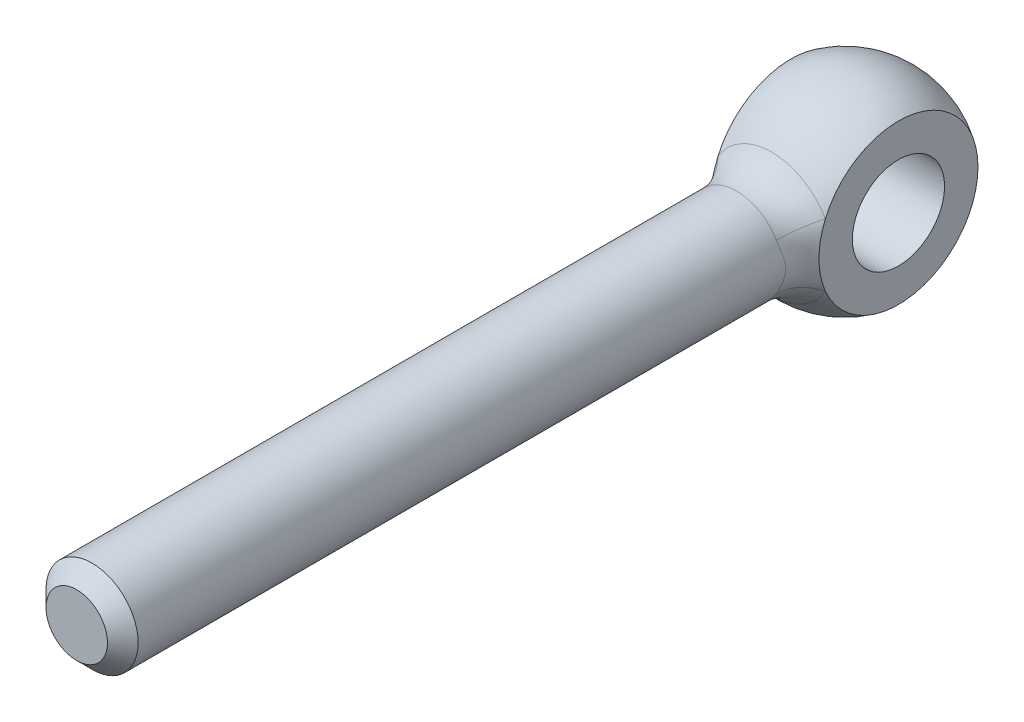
ISO-10303-21;
HEADER;
FILE_DESCRIPTION(('STEP AP214'),'2;1');
FILE_NAME('part.step','',(''),(''),'','','');
FILE_SCHEMA(('AUTOMOTIVE_DESIGN { 1 0 10303 214 1 1 1 1 }'));
ENDSEC;
DATA;
#1=APPLICATION_CONTEXT('core data for automotive mechanical design processes');
#2=APPLICATION_PROTOCOL_DEFINITION('international standard','automotive_design',2000,#1);
#3=PRODUCT_CONTEXT('',#1,'mechanical');
#4=PRODUCT('Part','Part','',(#3));
#5=PRODUCT_RELATED_PRODUCT_CATEGORY('part','',(#4));
#6=PRODUCT_DEFINITION_FORMATION('','',#4);
#7=PRODUCT_DEFINITION_CONTEXT('part definition',#1,'design');
#8=PRODUCT_DEFINITION('design','',#6,#7);
#9=PRODUCT_DEFINITION_SHAPE('','',#8);
#10=(LENGTH_UNIT() NAMED_UNIT(*) SI_UNIT(.MILLI.,.METRE.));
#11=(NAMED_UNIT(*) PLANE_ANGLE_UNIT() SI_UNIT($,.RADIAN.));
#12=(NAMED_UNIT(*) SI_UNIT($,.STERADIAN.) SOLID_ANGLE_UNIT());
#13=UNCERTAINTY_MEASURE_WITH_UNIT(LENGTH_MEASURE(1.E-05),#10,'distance_accuracy_value','');
#14=(GEOMETRIC_REPRESENTATION_CONTEXT(3) GLOBAL_UNCERTAINTY_ASSIGNED_CONTEXT((#13)) GLOBAL_UNIT_ASSIGNED_CONTEXT((#10,
#11,#12)) REPRESENTATION_CONTEXT('',''));
#15=CARTESIAN_POINT('',(0.,0.,0.));
#16=DIRECTION('',(0.,0.,1.));
#17=DIRECTION('',(1.,0.,0.));
#18=AXIS2_PLACEMENT_3D('',#15,#16,#17);
#19=CARTESIAN_POINT('',(0.,0.,0.));
#20=DIRECTION('',(-1.,0.,0.));
#21=DIRECTION('',(0.,0.,-1.));
#22=AXIS2_PLACEMENT_3D('',#19,#20,#21);
#23=SPHERICAL_SURFACE('',#22,12.5);
#24=CARTESIAN_POINT('',(7.,0.,0.));
#25=DIRECTION('',(1.,0.,0.));
#26=DIRECTION('',(0.,0.,1.));
#27=AXIS2_PLACEMENT_3D('',#24,#25,#26);
#28=CIRCLE('',#27,10.356157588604);
#29=CARTESIAN_POINT('',(7.,4.09162768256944,9.51359989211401));
#30=VERTEX_POINT('',#29);
#31=CARTESIAN_POINT('',(7.,-4.09162768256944,9.51359989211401));
#32=VERTEX_POINT('',#31);
#33=EDGE_CURVE('E64',#30,#32,#28,.F.);
#34=ORIENTED_EDGE('',*,*,#33,.T.);
#35=CARTESIAN_POINT('',(0.,0.,9.51359989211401));
#36=DIRECTION('',(0.,0.,-1.));
#37=DIRECTION('',(-1.,0.,0.));
#38=AXIS2_PLACEMENT_3D('',#35,#36,#37);
#39=CIRCLE('',#38,8.10810810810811);
#40=CARTESIAN_POINT('',(-7.,-4.09162768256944,9.51359989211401));
#41=VERTEX_POINT('',#40);
#42=EDGE_CURVE('E72',#32,#41,#39,.T.);
#43=ORIENTED_EDGE('',*,*,#42,.T.);
#44=CARTESIAN_POINT('',(-7.,0.,0.));
#45=DIRECTION('',(1.,0.,0.));
#46=DIRECTION('',(0.,0.,1.));
#47=AXIS2_PLACEMENT_3D('',#44,#45,#46);
#48=CIRCLE('',#47,10.356157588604);
#49=CARTESIAN_POINT('',(-7.,4.09162768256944,9.51359989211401));
#50=VERTEX_POINT('',#49);
#51=EDGE_CURVE('E60',#50,#41,#48,.F.);
#52=ORIENTED_EDGE('',*,*,#51,.F.);
#53=CARTESIAN_POINT('',(0.,0.,9.51359989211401));
#54=DIRECTION('',(0.,0.,-1.));
#55=DIRECTION('',(-1.,0.,0.));
#56=AXIS2_PLACEMENT_3D('',#53,#54,#55);
#57=CIRCLE('',#56,8.10810810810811);
#58=EDGE_CURVE('E69',#50,#30,#57,.T.);
#59=ORIENTED_EDGE('',*,*,#58,.T.);
#60=EDGE_LOOP('',(#34,#43,#52,#59));
#61=FACE_BOUND('',#60,.T.);
#62=ADVANCED_FACE('F14',(#61),#23,.T.);
#63=CARTESIAN_POINT('',(0.,0.,-10.));
#64=DIRECTION('',(0.,0.,-1.));
#65=DIRECTION('',(1.,0.,0.));
#66=AXIS2_PLACEMENT_3D('',#63,#64,#65);
#67=CYLINDRICAL_SURFACE('',#66,6.);
#68=CARTESIAN_POINT('',(7.,5.52065398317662,8.76198491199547));
#69=CARTESIAN_POINT('',(4.73347627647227,3.77093452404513,10.4723797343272));
#70=CARTESIAN_POINT('',(4.16393928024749,4.31990852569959,13.7124960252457));
#71=CARTESIAN_POINT('',(7.,5.43196770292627,8.81784504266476));
#72=CARTESIAN_POINT('',(4.75237008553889,3.73175735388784,10.5424849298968));
#73=CARTESIAN_POINT('',(4.24629318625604,4.24055975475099,13.7683625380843));
#74=CARTESIAN_POINT('',(7.,5.34113250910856,8.87321411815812));
#75=CARTESIAN_POINT('',(4.774361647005,3.69082707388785,10.6107881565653));
#76=CARTESIAN_POINT('',(4.32694937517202,4.15824402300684,13.8171854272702));
#77=CARTESIAN_POINT('',(7.,5.15454022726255,8.98290118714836));
#78=CARTESIAN_POINT('',(4.82415359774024,3.60403478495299,10.743005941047));
#79=CARTESIAN_POINT('',(4.48416075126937,3.98818699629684,13.9015926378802));
#80=CARTESIAN_POINT('',(7.,5.05878355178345,9.03721926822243));
#81=CARTESIAN_POINT('',(4.85191265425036,3.55821882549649,10.8069099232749));
#82=CARTESIAN_POINT('',(4.56071628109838,3.90044615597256,13.9371780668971));
#83=CARTESIAN_POINT('',(7.,4.86225075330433,9.14444949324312));
#84=CARTESIAN_POINT('',(4.91269251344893,3.46043710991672,10.9295511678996));
#85=CARTESIAN_POINT('',(4.70862752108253,3.72052921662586,13.9958066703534));
#86=CARTESIAN_POINT('',(7.,4.76150508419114,9.19736772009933));
#87=CARTESIAN_POINT('',(4.94564175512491,3.40856162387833,10.988313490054));
#88=CARTESIAN_POINT('',(4.78000947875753,3.62838012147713,14.0189176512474));
#89=CARTESIAN_POINT('',(7.,4.55392848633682,9.30189435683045));
#90=CARTESIAN_POINT('',(5.01603086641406,3.29716736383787,11.1005263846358));
#91=CARTESIAN_POINT('',(4.91748494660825,3.4397597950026,14.0539297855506));
#92=CARTESIAN_POINT('',(7.,4.44710008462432,9.35350329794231));
#93=CARTESIAN_POINT('',(5.05343304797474,3.23771146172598,11.1539919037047));
#94=CARTESIAN_POINT('',(4.98358062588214,3.3432903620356,14.0658355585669));
#95=CARTESIAN_POINT('',(7.,4.2969586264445,9.42274283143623));
#96=CARTESIAN_POINT('',(5.10676472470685,3.15059746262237,11.2230561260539));
#97=CARTESIAN_POINT('',(5.06977684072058,3.20923152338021,14.0752452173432));
#98=CARTESIAN_POINT('',(7.,4.25653508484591,9.44107582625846));
#99=CARTESIAN_POINT('',(5.12115703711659,3.12687435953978,11.2410365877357));
#100=CARTESIAN_POINT('',(5.09235610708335,3.17328084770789,14.0770920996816));
#101=CARTESIAN_POINT('',(7.,4.17477524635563,9.4775130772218));
#102=CARTESIAN_POINT('',(5.15031007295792,3.07824781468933,11.2762248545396));
#103=CARTESIAN_POINT('',(5.13675282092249,3.10089882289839,14.0795339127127));
#104=CARTESIAN_POINT('',(7.,4.13343888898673,9.4956173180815));
#105=CARTESIAN_POINT('',(5.16506981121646,3.05334717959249,11.2934339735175));
#106=CARTESIAN_POINT('',(5.15857021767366,3.06446744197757,14.0801287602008));
#107=CARTESIAN_POINT('',(7.,3.93727090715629,9.57998716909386));
#108=CARTESIAN_POINT('',(5.23484389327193,2.93397708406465,11.3720989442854));
#109=CARTESIAN_POINT('',(5.25911352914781,2.89245379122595,14.0801244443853));
#110=CARTESIAN_POINT('',(7.,3.77644238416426,9.64471624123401));
#111=CARTESIAN_POINT('',(5.29198516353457,2.8314905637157,11.4288485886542));
#112=CARTESIAN_POINT('',(5.33294423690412,2.75394693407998,14.0720012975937));
#113=CARTESIAN_POINT('',(7.,3.44057965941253,9.7695721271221));
#114=CARTESIAN_POINT('',(5.40674389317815,2.60847852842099,11.5309624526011));
#115=CARTESIAN_POINT('',(5.46944812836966,2.47178930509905,14.0431824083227));
#116=CARTESIAN_POINT('',(7.,3.26553398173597,9.82969514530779));
#117=CARTESIAN_POINT('',(5.46437197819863,2.48805001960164,11.5764173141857));
#118=CARTESIAN_POINT('',(5.53211216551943,2.3281344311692,14.0224764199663));
#119=CARTESIAN_POINT('',(7.,2.89956860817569,9.94381011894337));
#120=CARTESIAN_POINT('',(5.57626625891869,2.2285734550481,11.6561394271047));
#121=CARTESIAN_POINT('',(5.64613166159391,2.03613701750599,13.9728223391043));
#122=CARTESIAN_POINT('',(7.,2.70859175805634,9.99777819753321));
#123=CARTESIAN_POINT('',(5.63058064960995,2.08950571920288,11.6904716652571));
#124=CARTESIAN_POINT('',(5.69744376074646,1.88777889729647,13.9438435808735));
#125=CARTESIAN_POINT('',(7.,2.31090588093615,10.0971127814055));
#126=CARTESIAN_POINT('',(5.73158522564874,1.79407236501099,11.7485069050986));
#127=CARTESIAN_POINT('',(5.78825827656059,1.58765614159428,13.8830399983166));
#128=CARTESIAN_POINT('',(7.,2.10419766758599,10.1424797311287));
#129=CARTESIAN_POINT('',(5.77837504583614,1.6376681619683,11.7723070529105));
#130=CARTESIAN_POINT('',(5.82776130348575,1.43589168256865,13.8512153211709));
#131=CARTESIAN_POINT('',(7.,1.67085359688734,10.2229078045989));
#132=CARTESIAN_POINT('',(5.86150775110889,1.30600608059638,11.8111628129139));
#133=CARTESIAN_POINT('',(5.8955793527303,1.12600155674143,13.7902383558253));
#134=CARTESIAN_POINT('',(7.,1.44386630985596,10.2577049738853));
#135=CARTESIAN_POINT('',(5.8977103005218,1.13021047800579,11.8260828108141));
#136=CARTESIAN_POINT('',(5.92361308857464,0.967810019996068,13.7611653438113));
#137=CARTESIAN_POINT('',(7.,0.977611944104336,10.312575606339));
#138=CARTESIAN_POINT('',(5.95469562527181,0.767202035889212,11.8481867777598));
#139=CARTESIAN_POINT('',(5.96692621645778,0.649309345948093,13.7134560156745));
#140=CARTESIAN_POINT('',(7.,0.738348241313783,10.3326530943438));
#141=CARTESIAN_POINT('',(5.97558995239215,0.579692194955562,11.855420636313));
#142=CARTESIAN_POINT('',(5.98220909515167,0.489000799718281,13.6948168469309));
#143=CARTESIAN_POINT('',(7.,0.254575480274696,10.3558486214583));
#144=CARTESIAN_POINT('',(5.99967335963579,0.200191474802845,11.8636655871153));
#145=CARTESIAN_POINT('',(5.99980579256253,0.167748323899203,13.673156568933));
#146=CARTESIAN_POINT('',(7.,0.0100795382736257,10.3590049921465));
#147=CARTESIAN_POINT('',(6.0029543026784,0.00781202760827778,11.864708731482));
#148=CARTESIAN_POINT('',(6.00214892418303,0.00680665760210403,13.670100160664));
#149=CARTESIAN_POINT('',(7.,-0.476166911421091,10.3480653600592));
#150=CARTESIAN_POINT('',(5.99159819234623,-0.374022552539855,11.8609024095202));
#151=CARTESIAN_POINT('',(5.9939026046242,-0.314617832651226,13.6804268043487));
#152=CARTESIAN_POINT('',(7.,-0.717917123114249,10.3339675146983));
#153=CARTESIAN_POINT('',(5.97693421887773,-0.563895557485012,11.8560440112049));
#154=CARTESIAN_POINT('',(5.98331177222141,-0.475100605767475,13.6938116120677));
#155=CARTESIAN_POINT('',(7.,-1.17711086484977,10.2914790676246));
#156=CARTESIAN_POINT('',(5.93280719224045,-0.922682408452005,11.839841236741));
#157=CARTESIAN_POINT('',(5.95036755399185,-0.784814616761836,13.7319958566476));
#158=CARTESIAN_POINT('',(7.,-1.39514583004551,10.2639850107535));
#159=CARTESIAN_POINT('',(5.90419169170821,-1.09249310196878,11.8288660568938));
#160=CARTESIAN_POINT('',(5.92874844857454,-0.934149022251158,13.7560718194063));
#161=CARTESIAN_POINT('',(7.,-1.81839648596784,10.1975189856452));
#162=CARTESIAN_POINT('',(5.83527764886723,-1.41926666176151,11.7992510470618));
#163=CARTESIAN_POINT('',(5.87439634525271,-1.23051561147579,13.809953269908));
#164=CARTESIAN_POINT('',(7.,-2.02361108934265,10.1585460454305));
#165=CARTESIAN_POINT('',(5.79487748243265,-1.57641328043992,11.7805559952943));
#166=CARTESIAN_POINT('',(5.84166240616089,-1.37754759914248,13.8397592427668));
#167=CARTESIAN_POINT('',(7.,-2.41979553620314,10.0715339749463));
#168=CARTESIAN_POINT('',(5.70553324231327,-1.87549175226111,11.7340817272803));
#169=CARTESIAN_POINT('',(5.76521762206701,-1.66881679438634,13.8994060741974));
#170=CARTESIAN_POINT('',(7.,-2.61075717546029,10.0234896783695));
#171=CARTESIAN_POINT('',(5.65648641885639,-2.01749587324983,11.7062202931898));
#172=CARTESIAN_POINT('',(5.72150051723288,-1.81305235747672,13.9292469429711));
#173=CARTESIAN_POINT('',(7.,-2.97823759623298,9.92051035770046));
#174=CARTESIAN_POINT('',(5.55330052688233,-2.28497381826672,11.6404397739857));
#175=CARTESIAN_POINT('',(5.6232485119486,-2.09804332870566,13.9837841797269));
#176=CARTESIAN_POINT('',(7.,-3.15475790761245,9.86557606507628));
#177=CARTESIAN_POINT('',(5.49908883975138,-2.41044201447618,11.6024299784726));
#178=CARTESIAN_POINT('',(5.56871475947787,-2.2387991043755,14.0084810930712));
#179=CARTESIAN_POINT('',(7.,-3.47765739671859,9.7561304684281));
#180=CARTESIAN_POINT('',(5.39445517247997,-2.63320590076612,11.5201628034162));
#181=CARTESIAN_POINT('',(5.45483407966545,-2.50267587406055,14.0464316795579));
#182=CARTESIAN_POINT('',(7.,-3.62530052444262,9.70209213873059));
#183=CARTESIAN_POINT('',(5.34411434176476,-2.73206566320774,11.4767663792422));
#184=CARTESIAN_POINT('',(5.39646281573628,-2.62618577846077,14.0605611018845));
#185=CARTESIAN_POINT('',(7.,-3.9101338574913,9.59083995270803));
#186=CARTESIAN_POINT('',(5.2447017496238,-2.9165097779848,11.3815427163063));
#187=CARTESIAN_POINT('',(5.27135185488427,-2.86906036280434,14.0783371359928));
#188=CARTESIAN_POINT('',(7.,-4.04732718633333,9.53362705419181));
#189=CARTESIAN_POINT('',(5.19563379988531,-3.00201545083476,11.3296558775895));
#190=CARTESIAN_POINT('',(5.2046146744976,-2.98842627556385,14.0819868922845));
#191=CARTESIAN_POINT('',(7.,-4.31290967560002,9.41647692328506));
#192=CARTESIAN_POINT('',(5.10089049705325,-3.16117080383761,11.2175543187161));
#193=CARTESIAN_POINT('',(5.0627722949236,-3.22291536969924,14.0764425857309));
#194=CARTESIAN_POINT('',(7.,-4.44124691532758,9.35652657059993));
#195=CARTESIAN_POINT('',(5.05526955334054,-3.23465246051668,11.1572503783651));
#196=CARTESIAN_POINT('',(4.98762357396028,-3.33801195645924,14.0671785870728));
#197=CARTESIAN_POINT('',(7.,-4.68940217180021,9.23463387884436));
#198=CARTESIAN_POINT('',(4.96955301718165,-3.37092279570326,11.0291198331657));
#199=CARTESIAN_POINT('',(4.82981665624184,-3.56255813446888,14.0336945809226));
#200=CARTESIAN_POINT('',(7.,-4.80920993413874,9.17268926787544));
#201=CARTESIAN_POINT('',(4.92951762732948,-3.43360058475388,10.9612577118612));
#202=CARTESIAN_POINT('',(4.74714968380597,-3.67200088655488,14.0094568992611));
#203=CARTESIAN_POINT('',(7.,-4.92515727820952,9.11003983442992));
#204=CARTESIAN_POINT('',(4.89339612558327,-3.49152887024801,10.8902848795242));
#205=CARTESIAN_POINT('',(4.66109414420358,-3.77812140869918,13.9767461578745));
#206=(BOUNDED_SURFACE() B_SPLINE_SURFACE(3,2,((#68,#69,#70),(#71,#72,#73),(#74,#75,#76),(#77,
#78,#79),(#80,#81,#82),(#83,#84,#85),(#86,#87,#88),(#89,#90,#91),(#92,#93,#94),(#95,#96,#97),
(#98,#99,#100),(#101,#102,#103),(#104,#105,#106),(#107,#108,#109),(#110,#111,#112),(#113,#114,
#115),(#116,#117,#118),(#119,#120,#121),(#122,#123,#124),(#125,#126,#127),(#128,#129,#130),
(#131,#132,#133),(#134,#135,#136),(#137,#138,#139),(#140,#141,#142),(#143,#144,#145),(#146,#147,
#148),(#149,#150,#151),(#152,#153,#154),(#155,#156,#157),(#158,#159,#160),(#161,#162,#163),
(#164,#165,#166),(#167,#168,#169),(#170,#171,#172),(#173,#174,#175),(#176,#177,#178),(#179,#180,
#181),(#182,#183,#184),(#185,#186,#187),(#188,#189,#190),(#191,#192,#193),(#194,#195,#196),
(#197,#198,#199),(#200,#201,#202),(#203,#204,#205)),.UNSPECIFIED.,.F.,.F.,
.F.) B_SPLINE_SURFACE_WITH_KNOTS((4,2,2,2,2,2,2,2,2,2,2,2,2,2,2,2,2,2,2,2,2,2,4),(3,3),(0.,
0.706069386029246,1.41207968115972,2.11421270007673,2.8160561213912,3.07081429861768,
3.32558940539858,4.26615695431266,5.20749141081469,6.15236157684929,7.09718290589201,
8.06395765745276,9.03046796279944,9.99478789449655,10.9592108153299,11.8664791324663,
12.7738242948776,13.6816877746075,14.5894549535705,15.4094238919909,16.2291467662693,
17.0533262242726,17.8784803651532),(0.,1.),
.UNSPECIFIED.) GEOMETRIC_REPRESENTATION_ITEM() RATIONAL_B_SPLINE_SURFACE(((1.,0.874036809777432,
1.),(1.,0.875980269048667,1.),(1.,0.878049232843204,1.),(1.,0.882404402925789,1.),(1.,
0.884690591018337,1.),(1.,0.889433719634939,1.),(1.,0.891889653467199,1.),(1.,0.896934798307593,
1.),(1.,0.899523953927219,1.),(1.,0.903105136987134,1.),(1.,0.904063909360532,1.),(1.,
0.905988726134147,1.),(1.,0.906954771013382,1.),(1.,0.911497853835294,1.),(1.,0.915103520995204,
1.),(1.,0.922211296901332,1.),(1.,0.925713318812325,1.),(1.,0.932445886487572,1.),(1.,
0.935675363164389,1.),(1.,0.941657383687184,1.),(1.,0.944409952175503,1.),(1.,0.94930028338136,
1.),(1.,0.951422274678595,1.),(1.,0.95476877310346,1.),(1.,0.955993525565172,1.),(1.,
0.957408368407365,1.),(1.,0.957600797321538,1.),(1.,0.956933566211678,1.),(1.,0.956073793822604,
1.),(1.,0.953481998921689,1.),(1.,0.951804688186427,1.),(1.,0.947755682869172,1.),(1.,
0.94538392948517,1.),(1.,0.940114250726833,1.),(1.,0.937216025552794,1.),(1.,0.931066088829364,
1.),(1.,0.927814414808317,1.),(1.,0.921446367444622,1.),(1.,0.918347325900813,1.),(1.,
0.912110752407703,1.),(1.,0.908973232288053,1.),(1.,0.902748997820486,1.),(1.,0.899662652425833,
1.),(1.,0.893647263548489,1.),(1.,0.890718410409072,1.),(1.,0.887916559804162,1.))) REPRESENTATION_ITEM('') SURFACE());
#207=CARTESIAN_POINT('',(4.66109414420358,-3.77812140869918,13.9767461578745));
#208=CARTESIAN_POINT('',(4.74714968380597,-3.67200088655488,14.0094568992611));
#209=CARTESIAN_POINT('',(4.82981665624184,-3.56255813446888,14.0336945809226));
#210=CARTESIAN_POINT('',(4.98762357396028,-3.33801195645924,14.0671785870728));
#211=CARTESIAN_POINT('',(5.0627722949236,-3.22291536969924,14.0764425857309));
#212=CARTESIAN_POINT('',(5.2046146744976,-2.98842627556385,14.0819868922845));
#213=CARTESIAN_POINT('',(5.27135185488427,-2.86906036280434,14.0783371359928));
#214=CARTESIAN_POINT('',(5.39646281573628,-2.62618577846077,14.0605611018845));
#215=CARTESIAN_POINT('',(5.45483407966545,-2.50267587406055,14.0464316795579));
#216=CARTESIAN_POINT('',(5.56871475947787,-2.2387991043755,14.0084810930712));
#217=CARTESIAN_POINT('',(5.6232485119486,-2.09804332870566,13.9837841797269));
#218=CARTESIAN_POINT('',(5.72150051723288,-1.81305235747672,13.9292469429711));
#219=CARTESIAN_POINT('',(5.76521762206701,-1.66881679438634,13.8994060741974));
#220=CARTESIAN_POINT('',(5.84166240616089,-1.37754759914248,13.8397592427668));
#221=CARTESIAN_POINT('',(5.87439634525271,-1.23051561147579,13.809953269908));
#222=CARTESIAN_POINT('',(5.92874844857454,-0.934149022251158,13.7560718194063));
#223=CARTESIAN_POINT('',(5.95036755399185,-0.784814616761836,13.7319958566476));
#224=CARTESIAN_POINT('',(5.98331177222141,-0.475100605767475,13.6938116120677));
#225=CARTESIAN_POINT('',(5.9939026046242,-0.314617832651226,13.6804268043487));
#226=CARTESIAN_POINT('',(6.00214892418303,0.00680665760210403,13.670100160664));
#227=CARTESIAN_POINT('',(5.99980579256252,0.167748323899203,13.673156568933));
#228=CARTESIAN_POINT('',(5.98220909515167,0.489000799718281,13.6948168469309));
#229=CARTESIAN_POINT('',(5.96692621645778,0.649309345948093,13.7134560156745));
#230=CARTESIAN_POINT('',(5.92361308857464,0.967810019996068,13.7611653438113));
#231=CARTESIAN_POINT('',(5.8955793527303,1.12600155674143,13.7902383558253));
#232=CARTESIAN_POINT('',(5.82776130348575,1.43589168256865,13.8512153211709));
#233=CARTESIAN_POINT('',(5.78825827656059,1.58765614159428,13.8830399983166));
#234=CARTESIAN_POINT('',(5.69744376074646,1.88777889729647,13.9438435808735));
#235=CARTESIAN_POINT('',(5.64613166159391,2.03613701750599,13.9728223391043));
#236=CARTESIAN_POINT('',(5.53211216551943,2.3281344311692,14.0224764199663));
#237=CARTESIAN_POINT('',(5.46944812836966,2.47178930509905,14.0431824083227));
#238=CARTESIAN_POINT('',(5.33294423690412,2.75394693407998,14.0720012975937));
#239=CARTESIAN_POINT('',(5.2591135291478,2.89245379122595,14.0801244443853));
#240=CARTESIAN_POINT('',(5.15857021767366,3.06446744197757,14.0801287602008));
#241=CARTESIAN_POINT('',(5.13675282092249,3.10089882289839,14.0795339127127));
#242=CARTESIAN_POINT('',(5.09235610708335,3.17328084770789,14.0770920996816));
#243=CARTESIAN_POINT('',(5.06977684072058,3.20923152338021,14.0752452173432));
#244=CARTESIAN_POINT('',(4.98358062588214,3.3432903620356,14.0658355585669));
#245=CARTESIAN_POINT('',(4.91748494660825,3.4397597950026,14.0539297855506));
#246=CARTESIAN_POINT('',(4.78000947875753,3.62838012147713,14.0189176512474));
#247=CARTESIAN_POINT('',(4.70862752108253,3.72052921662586,13.9958066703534));
#248=CARTESIAN_POINT('',(4.56071628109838,3.90044615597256,13.9371780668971));
#249=CARTESIAN_POINT('',(4.48416075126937,3.98818699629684,13.9015926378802));
#250=CARTESIAN_POINT('',(4.32694937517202,4.15824402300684,13.8171854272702));
#251=CARTESIAN_POINT('',(4.24629318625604,4.24055975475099,13.7683625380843));
#252=CARTESIAN_POINT('',(4.16393928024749,4.31990852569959,13.7124960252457));
#253=B_SPLINE_CURVE_WITH_KNOTS('',3,(#207,#208,#209,#210,#211,#212,#213,#214,#215,#216,#217,
#218,#219,#220,#221,#222,#223,#224,#225,#226,#227,#228,#229,#230,#231,#232,#233,#234,#235,#236,
#237,#238,#239,#240,#241,#242,#243,#244,#245,#246,#247,#248,#249,#250,#251,#252),.UNSPECIFIED.,
.F.,.F.,(4,2,2,2,2,2,2,2,2,2,2,2,2,2,2,2,2,2,2,2,2,2,4),(0.,0.825154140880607,1.64933359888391,
2.46905647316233,3.28902541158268,4.19679259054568,5.10465607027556,6.01200123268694,
6.91926954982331,7.88369247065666,8.84801240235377,9.81452270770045,10.7812974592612,
11.7261187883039,12.6709889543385,13.6123234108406,14.5528909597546,14.8076660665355,
15.062424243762,15.7642676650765,16.4664006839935,17.172410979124,17.8784803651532),.UNSPECIFIED.);
#254=CARTESIAN_POINT('',(5.18,-3.02780448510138,14.0801278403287));
#255=VERTEX_POINT('',#254);
#256=CARTESIAN_POINT('',(5.18,3.02780448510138,14.0801278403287));
#257=VERTEX_POINT('',#256);
#258=EDGE_CURVE('E87',#255,#257,#253,.T.);
#259=ORIENTED_EDGE('',*,*,#258,.T.);
#260=CARTESIAN_POINT('',(0.,0.,14.0801278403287));
#261=DIRECTION('',(0.,0.,-1.));
#262=DIRECTION('',(-1.,0.,0.));
#263=AXIS2_PLACEMENT_3D('',#260,#261,#262);
#264=CIRCLE('',#263,6.);
#265=CARTESIAN_POINT('',(-5.18,3.02780448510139,14.0801278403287));
#266=VERTEX_POINT('',#265);
#267=EDGE_CURVE('E9',#257,#266,#264,.F.);
#268=ORIENTED_EDGE('',*,*,#267,.T.);
#269=CARTESIAN_POINT('',(-7.,-5.52065404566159,8.76198487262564));
#270=CARTESIAN_POINT('',(-4.73347625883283,-3.77093454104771,10.4723796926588));
#271=CARTESIAN_POINT('',(-4.16393928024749,-4.31990852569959,13.7124960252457));
#272=CARTESIAN_POINT('',(-7.,-5.43196772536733,8.81784502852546));
#273=CARTESIAN_POINT('',(-4.7523700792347,-3.73175735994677,10.5424849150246));
#274=CARTESIAN_POINT('',(-4.24629318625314,-4.24055975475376,13.7683625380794));
#275=CARTESIAN_POINT('',(-7.,-5.34113251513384,8.87321411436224));
#276=CARTESIAN_POINT('',(-4.77436164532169,-3.69082707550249,10.610788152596));
#277=CARTESIAN_POINT('',(-4.3269493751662,-4.15824402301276,13.8171854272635));
#278=CARTESIAN_POINT('',(-7.,-5.15454022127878,8.98290119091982));
#279=CARTESIAN_POINT('',(-4.82415359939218,-3.60403478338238,10.7430059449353));
#280=CARTESIAN_POINT('',(-4.48416075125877,-3.98818699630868,13.9015926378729));
#281=CARTESIAN_POINT('',(-7.,-5.05878355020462,9.03721926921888));
#282=CARTESIAN_POINT('',(-4.85191265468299,-3.55821882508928,10.8069099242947));
#283=CARTESIAN_POINT('',(-4.56071628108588,-3.90044615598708,13.937178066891));
#284=CARTESIAN_POINT('',(-7.,-4.86225075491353,9.14444949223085));
#285=CARTESIAN_POINT('',(-4.91269251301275,-3.46043711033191,10.9295511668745));
#286=CARTESIAN_POINT('',(-4.70862752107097,-3.7205292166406,13.9958066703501));
#287=CARTESIAN_POINT('',(-7.,-4.76150508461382,9.19736771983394));
#288=CARTESIAN_POINT('',(-4.94564175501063,-3.40856162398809,10.9883134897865));
#289=CARTESIAN_POINT('',(-4.78000947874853,-3.62838012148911,14.018917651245));
#290=CARTESIAN_POINT('',(-7.,-4.55392848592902,9.30189435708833));
#291=CARTESIAN_POINT('',(-5.0160308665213,-3.29716736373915,11.1005263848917));
#292=CARTESIAN_POINT('',(-4.91748494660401,-3.43975979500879,14.0539297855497));
#293=CARTESIAN_POINT('',(-7.,-4.44710008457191,9.35350329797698));
#294=CARTESIAN_POINT('',(-5.0534330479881,-3.23771146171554,11.1539919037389));
#295=CARTESIAN_POINT('',(-4.9835806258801,-3.34329036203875,14.0658355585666));
#296=CARTESIAN_POINT('',(-7.,-4.29695862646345,9.42274283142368));
#297=CARTESIAN_POINT('',(-5.10676472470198,-3.15059746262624,11.2230561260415));
#298=CARTESIAN_POINT('',(-5.06977684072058,-3.20923152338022,14.0752452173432));
#299=CARTESIAN_POINT('',(-7.,-4.25653508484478,9.44107582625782));
#300=CARTESIAN_POINT('',(-5.12115703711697,-3.12687435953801,11.241036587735));
#301=CARTESIAN_POINT('',(-5.09235610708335,-3.1732808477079,14.0770920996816));
#302=CARTESIAN_POINT('',(-7.,-4.17477524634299,9.47751307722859));
#303=CARTESIAN_POINT('',(-5.15031007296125,-3.07824781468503,11.2762248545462));
#304=CARTESIAN_POINT('',(-5.13675282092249,-3.1008988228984,14.0795339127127));
#305=CARTESIAN_POINT('',(-7.,-4.13343888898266,9.49561731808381));
#306=CARTESIAN_POINT('',(-5.16506981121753,-3.05334717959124,11.2934339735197));
#307=CARTESIAN_POINT('',(-5.15857021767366,-3.06446744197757,14.0801287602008));
#308=CARTESIAN_POINT('',(-7.,-3.93727090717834,9.57998716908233));
#309=CARTESIAN_POINT('',(-5.2348438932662,-2.93397708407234,11.3720989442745));
#310=CARTESIAN_POINT('',(-5.2591135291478,-2.89245379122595,14.0801244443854));
#311=CARTESIAN_POINT('',(-7.,-3.77644238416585,9.64471624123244));
#312=CARTESIAN_POINT('',(-5.29198516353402,-2.83149056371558,11.4288485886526));
#313=CARTESIAN_POINT('',(-5.33294423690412,-2.75394693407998,14.0720012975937));
#314=CARTESIAN_POINT('',(-7.,-3.44057965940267,9.76957212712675));
#315=CARTESIAN_POINT('',(-5.4067438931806,-2.60847852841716,11.5309624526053));
#316=CARTESIAN_POINT('',(-5.46944812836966,-2.47178930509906,14.0431824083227));
#317=CARTESIAN_POINT('',(-7.,-3.26553398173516,9.82969514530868));
#318=CARTESIAN_POINT('',(-5.46437197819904,-2.48805001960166,11.5764173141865));
#319=CARTESIAN_POINT('',(-5.53211216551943,-2.32813443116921,14.0224764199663));
#320=CARTESIAN_POINT('',(-7.,-2.89956860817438,9.94381011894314));
#321=CARTESIAN_POINT('',(-5.5762662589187,-2.228573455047,11.6561394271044));
#322=CARTESIAN_POINT('',(-5.64613166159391,-2.036137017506,13.9728223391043));
#323=CARTESIAN_POINT('',(-7.,-2.70859175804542,9.99777819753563));
#324=CARTESIAN_POINT('',(-5.63058064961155,-2.08950571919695,11.690471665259));
#325=CARTESIAN_POINT('',(-5.69744376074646,-1.88777889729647,13.9438435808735));
#326=CARTESIAN_POINT('',(-7.,-2.31090588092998,10.0971127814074));
#327=CARTESIAN_POINT('',(-5.73158522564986,-1.79407236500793,11.7485069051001));
#328=CARTESIAN_POINT('',(-5.78825827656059,-1.58765614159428,13.8830399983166));
#329=CARTESIAN_POINT('',(-7.,-2.10419766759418,10.1424797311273));
#330=CARTESIAN_POINT('',(-5.77837504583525,-1.63766816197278,11.7723070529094));
#331=CARTESIAN_POINT('',(-5.82776130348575,-1.43589168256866,13.8512153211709));
#332=CARTESIAN_POINT('',(-7.,-1.67085359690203,10.222907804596));
#333=CARTESIAN_POINT('',(-5.86150775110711,-1.30600608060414,11.8111628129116));
#334=CARTESIAN_POINT('',(-5.8955793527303,-1.12600155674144,13.7902383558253));
#335=CARTESIAN_POINT('',(-7.,-1.44386630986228,10.2577049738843));
#336=CARTESIAN_POINT('',(-5.89771030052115,-1.13021047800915,11.8260828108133));
#337=CARTESIAN_POINT('',(-5.92361308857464,-0.967810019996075,13.7611653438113));
#338=CARTESIAN_POINT('',(-7.,-0.977611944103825,10.3125756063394));
#339=CARTESIAN_POINT('',(-5.95469562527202,-0.767202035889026,11.8481867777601));
#340=CARTESIAN_POINT('',(-5.96692621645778,-0.649309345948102,13.7134560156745));
#341=CARTESIAN_POINT('',(-7.,-0.738348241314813,10.3326530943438));
#342=CARTESIAN_POINT('',(-5.9755899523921,-0.579692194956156,11.855420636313));
#343=CARTESIAN_POINT('',(-5.98220909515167,-0.489000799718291,13.6948168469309));
#344=CARTESIAN_POINT('',(-7.,-0.254575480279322,10.3558486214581));
#345=CARTESIAN_POINT('',(-5.99967335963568,-0.200191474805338,11.8636655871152));
#346=CARTESIAN_POINT('',(-5.99980579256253,-0.167748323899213,13.673156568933));
#347=CARTESIAN_POINT('',(-7.,-0.0100795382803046,10.3590049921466));
#348=CARTESIAN_POINT('',(-6.00295430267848,-0.00781202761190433,11.8647087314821));
#349=CARTESIAN_POINT('',(-6.00214892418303,-0.0068066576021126,13.670100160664));
#350=CARTESIAN_POINT('',(-7.,0.476166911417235,10.3480653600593));
#351=CARTESIAN_POINT('',(-5.99159819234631,0.374022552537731,11.8609024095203));
#352=CARTESIAN_POINT('',(-5.9939026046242,0.314617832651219,13.6804268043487));
#353=CARTESIAN_POINT('',(-7.,0.717917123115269,10.3339675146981));
#354=CARTESIAN_POINT('',(-5.97693421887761,0.563895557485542,11.8560440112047));
#355=CARTESIAN_POINT('',(-5.98331177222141,0.475100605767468,13.6938116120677));
#356=CARTESIAN_POINT('',(-7.,1.17711086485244,10.2914790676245));
#357=CARTESIAN_POINT('',(-5.93280719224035,0.922682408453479,11.8398412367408));
#358=CARTESIAN_POINT('',(-5.95036755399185,0.784814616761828,13.7319958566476));
#359=CARTESIAN_POINT('',(-7.,1.39514583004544,10.2639850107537));
#360=CARTESIAN_POINT('',(-5.90419169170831,1.09249310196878,11.8288660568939));
#361=CARTESIAN_POINT('',(-5.92874844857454,0.934149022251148,13.7560718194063));
#362=CARTESIAN_POINT('',(-7.,1.8183964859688,10.1975189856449));
#363=CARTESIAN_POINT('',(-5.83527764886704,1.41926666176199,11.7992510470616));
#364=CARTESIAN_POINT('',(-5.87439634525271,1.23051561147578,13.809953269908));
#365=CARTESIAN_POINT('',(-7.,2.02361108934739,10.1585460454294));
#366=CARTESIAN_POINT('',(-5.79487748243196,1.5764132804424,11.7805559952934));
#367=CARTESIAN_POINT('',(-5.84166240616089,1.37754759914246,13.8397592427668));
#368=CARTESIAN_POINT('',(-7.,2.4197955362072,10.0715339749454));
#369=CARTESIAN_POINT('',(-5.70553324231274,1.8754917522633,11.7340817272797));
#370=CARTESIAN_POINT('',(-5.76521762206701,1.66881679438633,13.8994060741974));
#371=CARTESIAN_POINT('',(-7.,2.61075717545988,10.0234896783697));
#372=CARTESIAN_POINT('',(-5.65648641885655,2.01749587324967,11.70622029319));
#373=CARTESIAN_POINT('',(-5.72150051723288,1.81305235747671,13.9292469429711));
#374=CARTESIAN_POINT('',(-7.,2.97823759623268,9.9205103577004));
#375=CARTESIAN_POINT('',(-5.5533005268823,2.28497381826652,11.6404397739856));
#376=CARTESIAN_POINT('',(-5.6232485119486,2.09804332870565,13.9837841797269));
#377=CARTESIAN_POINT('',(-7.,3.15475790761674,9.86557606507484));
#378=CARTESIAN_POINT('',(-5.49908883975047,2.41044201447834,11.6024299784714));
#379=CARTESIAN_POINT('',(-5.56871475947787,2.23879910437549,14.0084810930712));
#380=CARTESIAN_POINT('',(-7.,3.47765739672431,9.75613046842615));
#381=CARTESIAN_POINT('',(-5.39445517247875,2.63320590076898,11.5201628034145));
#382=CARTESIAN_POINT('',(-5.45483407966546,2.50267587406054,14.0464316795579));
#383=CARTESIAN_POINT('',(-7.,3.62530052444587,9.70209213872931));
#384=CARTESIAN_POINT('',(-5.34411434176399,2.73206566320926,11.4767663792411));
#385=CARTESIAN_POINT('',(-5.39646281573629,2.62618577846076,14.0605611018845));
#386=CARTESIAN_POINT('',(-7.,3.91013385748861,9.59083995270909));
#387=CARTESIAN_POINT('',(-5.24470174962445,2.91650977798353,11.3815427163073));
#388=CARTESIAN_POINT('',(-5.27135185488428,2.86906036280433,14.0783371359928));
#389=CARTESIAN_POINT('',(-7.,4.04732718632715,9.53362705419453));
#390=CARTESIAN_POINT('',(-5.19563379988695,3.00201545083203,11.329655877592));
#391=CARTESIAN_POINT('',(-5.20461467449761,2.98842627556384,14.0819868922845));
#392=CARTESIAN_POINT('',(-7.,4.31290967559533,9.41647692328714));
#393=CARTESIAN_POINT('',(-5.10089049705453,3.16117080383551,11.217554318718));
#394=CARTESIAN_POINT('',(-5.06277229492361,3.22291536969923,14.0764425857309));
#395=CARTESIAN_POINT('',(-7.,4.44124691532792,9.35652657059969));
#396=CARTESIAN_POINT('',(-5.05526955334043,3.23465246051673,11.1572503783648));
#397=CARTESIAN_POINT('',(-4.98762357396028,3.33801195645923,14.0671785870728));
#398=CARTESIAN_POINT('',(-7.,4.68940217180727,9.23463387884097));
#399=CARTESIAN_POINT('',(-4.96955301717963,3.37092279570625,11.0291198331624));
#400=CARTESIAN_POINT('',(-4.82981665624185,3.56255813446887,14.0336945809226));
#401=CARTESIAN_POINT('',(-7.,4.80920993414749,9.17268926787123));
#402=CARTESIAN_POINT('',(-4.92951762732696,3.4336005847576,10.9612577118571));
#403=CARTESIAN_POINT('',(-4.74714968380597,3.67200088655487,14.0094568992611));
#404=CARTESIAN_POINT('',(-7.,4.92515727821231,9.11003983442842));
#405=CARTESIAN_POINT('',(-4.89339612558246,3.49152887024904,10.8902848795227));
#406=CARTESIAN_POINT('',(-4.66109414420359,3.77812140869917,13.9767461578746));
#407=(BOUNDED_SURFACE() B_SPLINE_SURFACE(3,2,((#269,#270,#271),(#272,#273,#274),(#275,#276,
#277),(#278,#279,#280),(#281,#282,#283),(#284,#285,#286),(#287,#288,#289),(#290,#291,#292),
(#293,#294,#295),(#296,#297,#298),(#299,#300,#301),(#302,#303,#304),(#305,#306,#307),(#308,#309,
#310),(#311,#312,#313),(#314,#315,#316),(#317,#318,#319),(#320,#321,#322),(#323,#324,#325),
(#326,#327,#328),(#329,#330,#331),(#332,#333,#334),(#335,#336,#337),(#338,#339,#340),(#341,#342,
#343),(#344,#345,#346),(#347,#348,#349),(#350,#351,#352),(#353,#354,#355),(#356,#357,#358),
(#359,#360,#361),(#362,#363,#364),(#365,#366,#367),(#368,#369,#370),(#371,#372,#373),(#374,#375,
#376),(#377,#378,#379),(#380,#381,#382),(#383,#384,#385),(#386,#387,#388),(#389,#390,#391),
(#392,#393,#394),(#395,#396,#397),(#398,#399,#400),(#401,#402,#403),(#404,#405,#406)),
.UNSPECIFIED.,.F.,.F.,.F.) B_SPLINE_SURFACE_WITH_KNOTS((4,2,2,2,2,2,2,2,2,2,2,2,2,2,2,2,2,2,2,2,
2,2,4),(3,3),(0.,0.7060693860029,1.41207968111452,2.11421270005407,2.81605612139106,
3.07081429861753,3.32558940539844,4.26615695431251,5.20749141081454,6.15236157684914,
7.09718290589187,8.06395765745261,9.03046796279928,9.9947878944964,10.9592108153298,
11.8664791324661,12.7738242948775,13.6816877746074,14.5894549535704,15.4094238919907,
16.2291467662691,17.0533262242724,17.8784803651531),(0.,1.),
.UNSPECIFIED.) GEOMETRIC_REPRESENTATION_ITEM() RATIONAL_B_SPLINE_SURFACE(((1.,0.874036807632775,
1.),(1.,0.875980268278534,1.),(1.,0.87804923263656,1.),(1.,0.88240440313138,1.),(1.,
0.884690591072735,1.),(1.,0.889433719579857,1.),(1.,0.891889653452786,1.),(1.,0.896934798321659,
1.),(1.,0.899523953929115,1.),(1.,0.903105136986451,1.),(1.,0.904063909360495,1.),(1.,
0.905988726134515,1.),(1.,0.906954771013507,1.),(1.,0.911497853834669,1.),(1.,0.915103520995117,
1.),(1.,0.922211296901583,1.),(1.,0.925713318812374,1.),(1.,0.932445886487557,1.),(1.,
0.935675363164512,1.),(1.,0.94165738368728,1.),(1.,0.944409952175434,1.),(1.,0.949300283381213,
1.),(1.,0.951422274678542,1.),(1.,0.954768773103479,1.),(1.,0.955993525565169,1.),(1.,
0.957408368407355,1.),(1.,0.957600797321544,1.),(1.,0.956933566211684,1.),(1.,0.956073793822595,
1.),(1.,0.953481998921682,1.),(1.,0.951804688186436,1.),(1.,0.947755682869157,1.),(1.,
0.945383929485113,1.),(1.,0.94011425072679,1.),(1.,0.937216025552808,1.),(1.,0.931066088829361,
1.),(1.,0.927814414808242,1.),(1.,0.92144636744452,1.),(1.,0.918347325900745,1.),(1.,
0.91211075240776,1.),(1.,0.9089732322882,1.),(1.,0.902748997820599,1.),(1.,0.89966265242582,1.),
(1.,0.893647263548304,1.),(1.,0.890718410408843,1.),(1.,0.887916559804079,1.))) REPRESENTATION_ITEM('') SURFACE());
#408=CARTESIAN_POINT('',(-4.66109414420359,3.77812140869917,13.9767461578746));
#409=CARTESIAN_POINT('',(-4.74714968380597,3.67200088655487,14.0094568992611));
#410=CARTESIAN_POINT('',(-4.82981665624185,3.56255813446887,14.0336945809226));
#411=CARTESIAN_POINT('',(-4.98762357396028,3.33801195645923,14.0671785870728));
#412=CARTESIAN_POINT('',(-5.06277229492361,3.22291536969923,14.0764425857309));
#413=CARTESIAN_POINT('',(-5.20461467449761,2.98842627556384,14.0819868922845));
#414=CARTESIAN_POINT('',(-5.27135185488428,2.86906036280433,14.0783371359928));
#415=CARTESIAN_POINT('',(-5.39646281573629,2.62618577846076,14.0605611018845));
#416=CARTESIAN_POINT('',(-5.45483407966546,2.50267587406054,14.0464316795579));
#417=CARTESIAN_POINT('',(-5.56871475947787,2.23879910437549,14.0084810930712));
#418=CARTESIAN_POINT('',(-5.6232485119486,2.09804332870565,13.9837841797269));
#419=CARTESIAN_POINT('',(-5.72150051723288,1.81305235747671,13.9292469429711));
#420=CARTESIAN_POINT('',(-5.76521762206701,1.66881679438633,13.8994060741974));
#421=CARTESIAN_POINT('',(-5.84166240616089,1.37754759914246,13.8397592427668));
#422=CARTESIAN_POINT('',(-5.87439634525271,1.23051561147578,13.809953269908));
#423=CARTESIAN_POINT('',(-5.92874844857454,0.934149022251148,13.7560718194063));
#424=CARTESIAN_POINT('',(-5.95036755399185,0.784814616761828,13.7319958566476));
#425=CARTESIAN_POINT('',(-5.98331177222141,0.475100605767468,13.6938116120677));
#426=CARTESIAN_POINT('',(-5.9939026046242,0.314617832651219,13.6804268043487));
#427=CARTESIAN_POINT('',(-6.00214892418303,-0.00680665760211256,13.670100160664));
#428=CARTESIAN_POINT('',(-5.99980579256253,-0.167748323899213,13.673156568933));
#429=CARTESIAN_POINT('',(-5.98220909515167,-0.489000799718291,13.6948168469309));
#430=CARTESIAN_POINT('',(-5.96692621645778,-0.649309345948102,13.7134560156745));
#431=CARTESIAN_POINT('',(-5.92361308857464,-0.967810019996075,13.7611653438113));
#432=CARTESIAN_POINT('',(-5.8955793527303,-1.12600155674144,13.7902383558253));
#433=CARTESIAN_POINT('',(-5.82776130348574,-1.43589168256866,13.8512153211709));
#434=CARTESIAN_POINT('',(-5.78825827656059,-1.58765614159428,13.8830399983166));
#435=CARTESIAN_POINT('',(-5.69744376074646,-1.88777889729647,13.9438435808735));
#436=CARTESIAN_POINT('',(-5.64613166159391,-2.036137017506,13.9728223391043));
#437=CARTESIAN_POINT('',(-5.53211216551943,-2.32813443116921,14.0224764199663));
#438=CARTESIAN_POINT('',(-5.46944812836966,-2.47178930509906,14.0431824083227));
#439=CARTESIAN_POINT('',(-5.33294423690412,-2.75394693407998,14.0720012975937));
#440=CARTESIAN_POINT('',(-5.2591135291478,-2.89245379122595,14.0801244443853));
#441=CARTESIAN_POINT('',(-5.15857021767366,-3.06446744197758,14.0801287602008));
#442=CARTESIAN_POINT('',(-5.13675282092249,-3.1008988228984,14.0795339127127));
#443=CARTESIAN_POINT('',(-5.09235610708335,-3.1732808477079,14.0770920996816));
#444=CARTESIAN_POINT('',(-5.06977684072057,-3.20923152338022,14.0752452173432));
#445=CARTESIAN_POINT('',(-4.98358062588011,-3.34329036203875,14.0658355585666));
#446=CARTESIAN_POINT('',(-4.91748494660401,-3.43975979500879,14.0539297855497));
#447=CARTESIAN_POINT('',(-4.78000947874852,-3.62838012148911,14.018917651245));
#448=CARTESIAN_POINT('',(-4.70862752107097,-3.7205292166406,13.9958066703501));
#449=CARTESIAN_POINT('',(-4.56071628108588,-3.90044615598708,13.937178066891));
#450=CARTESIAN_POINT('',(-4.48416075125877,-3.98818699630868,13.9015926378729));
#451=CARTESIAN_POINT('',(-4.3269493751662,-4.15824402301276,13.8171854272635));
#452=CARTESIAN_POINT('',(-4.24629318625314,-4.24055975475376,13.7683625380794));
#453=CARTESIAN_POINT('',(-4.16393928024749,-4.31990852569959,13.7124960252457));
#454=B_SPLINE_CURVE_WITH_KNOTS('',3,(#408,#409,#410,#411,#412,#413,#414,#415,#416,#417,#418,
#419,#420,#421,#422,#423,#424,#425,#426,#427,#428,#429,#430,#431,#432,#433,#434,#435,#436,#437,
#438,#439,#440,#441,#442,#443,#444,#445,#446,#447,#448,#449,#450,#451,#452,#453),.UNSPECIFIED.,
.F.,.F.,(4,2,2,2,2,2,2,2,2,2,2,2,2,2,2,2,2,2,2,2,2,2,4),(0.,0.825154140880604,1.64933359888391,
2.46905647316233,3.28902541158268,4.19679259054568,5.10465607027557,6.01200123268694,
6.9192695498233,7.88369247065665,8.84801240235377,9.81452270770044,10.7812974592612,
11.7261187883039,12.6709889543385,13.6123234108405,14.5528909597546,14.8076660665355,
15.062424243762,15.764267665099,16.4664006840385,17.1724109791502,17.8784803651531),.UNSPECIFIED.);
#455=CARTESIAN_POINT('',(-5.18,-3.02780448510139,14.0801278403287));
#456=VERTEX_POINT('',#455);
#457=EDGE_CURVE('E27',#266,#456,#454,.T.);
#458=ORIENTED_EDGE('',*,*,#457,.T.);
#459=CARTESIAN_POINT('',(0.,0.,14.0801278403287));
#460=DIRECTION('',(0.,0.,-1.));
#461=DIRECTION('',(-1.,0.,0.));
#462=AXIS2_PLACEMENT_3D('',#459,#460,#461);
#463=CIRCLE('',#462,6.);
#464=EDGE_CURVE('E101',#456,#255,#463,.F.);
#465=ORIENTED_EDGE('',*,*,#464,.T.);
#466=EDGE_LOOP('',(#259,#268,#458,#465));
#467=FACE_BOUND('',#466,.T.);
#468=CARTESIAN_POINT('',(0.,0.,98.));
#469=DIRECTION('',(0.,0.,-1.));
#470=DIRECTION('',(1.,0.,0.));
#471=AXIS2_PLACEMENT_3D('',#468,#469,#470);
#472=CIRCLE('',#471,6.);
#473=CARTESIAN_POINT('',(6.,0.,98.));
#474=VERTEX_POINT('',#473);
#475=EDGE_CURVE('E85',#474,#474,#472,.T.);
#476=ORIENTED_EDGE('',*,*,#475,.T.);
#477=EDGE_LOOP('',(#476));
#478=FACE_BOUND('',#477,.T.);
#479=ADVANCED_FACE('F107',(#467,#478),#67,.T.);
#480=CARTESIAN_POINT('',(0.,0.,100.));
#481=DIRECTION('',(0.,0.,-1.));
#482=DIRECTION('',(1.,0.,0.));
#483=AXIS2_PLACEMENT_3D('',#480,#481,#482);
#484=CONICAL_SURFACE('',#483,4.,0.785398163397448);
#485=ORIENTED_EDGE('',*,*,#475,.F.);
#486=EDGE_LOOP('',(#485));
#487=FACE_BOUND('',#486,.T.);
#488=CARTESIAN_POINT('',(0.,0.,100.));
#489=DIRECTION('',(0.,0.,-1.));
#490=DIRECTION('',(1.,0.,0.));
#491=AXIS2_PLACEMENT_3D('',#488,#489,#490);
#492=CIRCLE('',#491,4.);
#493=CARTESIAN_POINT('',(4.,0.,100.));
#494=VERTEX_POINT('',#493);
#495=EDGE_CURVE('E73',#494,#494,#492,.T.);
#496=ORIENTED_EDGE('',*,*,#495,.T.);
#497=EDGE_LOOP('',(#496));
#498=FACE_BOUND('',#497,.T.);
#499=ADVANCED_FACE('F111',(#487,#498),#484,.T.);
#500=CARTESIAN_POINT('',(0.,-4.,100.));
#501=DIRECTION('',(0.,0.,1.));
#502=DIRECTION('',(-1.,0.,0.));
#503=AXIS2_PLACEMENT_3D('',#500,#501,#502);
#504=PLANE('',#503);
#505=ORIENTED_EDGE('',*,*,#495,.F.);
#506=EDGE_LOOP('',(#505));
#507=FACE_BOUND('',#506,.T.);
#508=ADVANCED_FACE('F158',(#507),#504,.T.);
#509=CARTESIAN_POINT('',(-7.,15.,-19.9999999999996));
#510=DIRECTION('',(1.,0.,0.));
#511=DIRECTION('',(0.,0.,1.));
#512=AXIS2_PLACEMENT_3D('',#509,#510,#511);
#513=PLANE('',#512);
#514=CARTESIAN_POINT('',(-7.,0.,0.));
#515=DIRECTION('',(1.,0.,0.));
#516=DIRECTION('',(0.,0.,1.));
#517=AXIS2_PLACEMENT_3D('',#514,#515,#516);
#518=CIRCLE('',#517,6.);
#519=CARTESIAN_POINT('',(-7.,0.,6.));
#520=VERTEX_POINT('',#519);
#521=EDGE_CURVE('E253',#520,#520,#518,.T.);
#522=ORIENTED_EDGE('',*,*,#521,.T.);
#523=EDGE_LOOP('',(#522));
#524=FACE_BOUND('',#523,.T.);
#525=ORIENTED_EDGE('',*,*,#51,.T.);
#526=EDGE_CURVE('E57',#41,#50,#48,.F.);
#527=ORIENTED_EDGE('',*,*,#526,.T.);
#528=EDGE_LOOP('',(#525,#527));
#529=FACE_BOUND('',#528,.T.);
#530=ADVANCED_FACE('F59',(#524,#529),#513,.F.);
#531=CARTESIAN_POINT('',(7.,15.,-19.9999999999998));
#532=DIRECTION('',(1.,0.,0.));
#533=DIRECTION('',(0.,0.,1.));
#534=AXIS2_PLACEMENT_3D('',#531,#532,#533);
#535=PLANE('',#534);
#536=CARTESIAN_POINT('',(7.,0.,0.));
#537=DIRECTION('',(1.,0.,0.));
#538=DIRECTION('',(0.,0.,1.));
#539=AXIS2_PLACEMENT_3D('',#536,#537,#538);
#540=CIRCLE('',#539,6.);
#541=CARTESIAN_POINT('',(7.,0.,6.));
#542=VERTEX_POINT('',#541);
#543=EDGE_CURVE('E78',#542,#542,#540,.T.);
#544=ORIENTED_EDGE('',*,*,#543,.F.);
#545=EDGE_LOOP('',(#544));
#546=FACE_BOUND('',#545,.T.);
#547=ORIENTED_EDGE('',*,*,#33,.F.);
#548=EDGE_CURVE('E249',#32,#30,#28,.F.);
#549=ORIENTED_EDGE('',*,*,#548,.F.);
#550=EDGE_LOOP('',(#547,#549));
#551=FACE_BOUND('',#550,.T.);
#552=ADVANCED_FACE('F151',(#546,#551),#535,.T.);
#553=CARTESIAN_POINT('',(10.,0.,0.));
#554=DIRECTION('',(-1.,0.,0.));
#555=DIRECTION('',(0.,0.,-1.));
#556=AXIS2_PLACEMENT_3D('',#553,#554,#555);
#557=CYLINDRICAL_SURFACE('',#556,6.);
#558=ORIENTED_EDGE('',*,*,#543,.T.);
#559=EDGE_LOOP('',(#558));
#560=FACE_BOUND('',#559,.T.);
#561=ORIENTED_EDGE('',*,*,#521,.F.);
#562=EDGE_LOOP('',(#561));
#563=FACE_BOUND('',#562,.T.);
#564=ADVANCED_FACE('F126',(#560,#563),#557,.F.);
#565=CARTESIAN_POINT('',(-10.36,-6.05560897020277,14.0801278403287));
#566=DIRECTION('',(0.50463408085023,-0.863333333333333,0.));
#567=DIRECTION('',(0.863333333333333,0.50463408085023,0.));
#568=AXIS2_PLACEMENT_3D('',#565,#566,#567);
#569=CIRCLE('',#568,6.);
#570=EDGE_CURVE('E79',#456,#41,#569,.F.);
#571=ORIENTED_EDGE('',*,*,#570,.F.);
#572=ORIENTED_EDGE('',*,*,#457,.F.);
#573=CARTESIAN_POINT('',(-10.36,6.05560897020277,14.0801278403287));
#574=DIRECTION('',(-0.504634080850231,-0.863333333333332,0.));
#575=DIRECTION('',(0.863333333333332,-0.504634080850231,0.));
#576=AXIS2_PLACEMENT_3D('',#573,#574,#575);
#577=CIRCLE('',#576,6.);
#578=EDGE_CURVE('E75',#50,#266,#577,.T.);
#579=ORIENTED_EDGE('',*,*,#578,.F.);
#580=ORIENTED_EDGE('',*,*,#526,.F.);
#581=EDGE_LOOP('',(#571,#572,#579,#580));
#582=FACE_BOUND('',#581,.T.);
#583=ADVANCED_FACE('F76',(#582),#407,.F.);
#584=CARTESIAN_POINT('',(0.,0.,14.0801278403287));
#585=DIRECTION('',(0.,0.,-1.));
#586=DIRECTION('',(-1.,0.,0.));
#587=AXIS2_PLACEMENT_3D('',#584,#585,#586);
#588=TOROIDAL_SURFACE('',#587,12.,6.);
#589=ORIENTED_EDGE('',*,*,#578,.T.);
#590=ORIENTED_EDGE('',*,*,#267,.F.);
#591=CARTESIAN_POINT('',(10.36,6.05560897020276,14.0801278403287));
#592=DIRECTION('',(-0.50463408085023,0.863333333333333,0.));
#593=DIRECTION('',(-0.863333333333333,-0.50463408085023,0.));
#594=AXIS2_PLACEMENT_3D('',#591,#592,#593);
#595=CIRCLE('',#594,6.);
#596=EDGE_CURVE('E83',#30,#257,#595,.T.);
#597=ORIENTED_EDGE('',*,*,#596,.F.);
#598=ORIENTED_EDGE('',*,*,#58,.F.);
#599=EDGE_LOOP('',(#589,#590,#597,#598));
#600=FACE_BOUND('',#599,.T.);
#601=ADVANCED_FACE('F82',(#600),#588,.F.);
#602=CARTESIAN_POINT('',(0.,0.,14.0801278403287));
#603=DIRECTION('',(0.,0.,-1.));
#604=DIRECTION('',(-1.,0.,0.));
#605=AXIS2_PLACEMENT_3D('',#602,#603,#604);
#606=TOROIDAL_SURFACE('',#605,12.,6.);
#607=ORIENTED_EDGE('',*,*,#570,.T.);
#608=ORIENTED_EDGE('',*,*,#42,.F.);
#609=CARTESIAN_POINT('',(10.36,-6.05560897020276,14.0801278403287));
#610=DIRECTION('',(-0.50463408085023,-0.863333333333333,0.));
#611=DIRECTION('',(0.863333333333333,-0.50463408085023,0.));
#612=AXIS2_PLACEMENT_3D('',#609,#610,#611);
#613=CIRCLE('',#612,6.);
#614=EDGE_CURVE('E136',#255,#32,#613,.T.);
#615=ORIENTED_EDGE('',*,*,#614,.F.);
#616=ORIENTED_EDGE('',*,*,#464,.F.);
#617=EDGE_LOOP('',(#607,#608,#615,#616));
#618=FACE_BOUND('',#617,.T.);
#619=ADVANCED_FACE('F226',(#618),#606,.F.);
#620=ORIENTED_EDGE('',*,*,#596,.T.);
#621=ORIENTED_EDGE('',*,*,#258,.F.);
#622=ORIENTED_EDGE('',*,*,#614,.T.);
#623=ORIENTED_EDGE('',*,*,#548,.T.);
#624=EDGE_LOOP('',(#620,#621,#622,#623));
#625=FACE_BOUND('',#624,.T.);
#626=ADVANCED_FACE('F116',(#625),#206,.F.);
#627=CLOSED_SHELL('',(#62,#479,#499,#508,#530,#552,#564,#583,#601,#619,#626));
#628=MANIFOLD_SOLID_BREP('B1',#627);
#629=ADVANCED_BREP_SHAPE_REPRESENTATION('',(#18,#628),#14);
#630=SHAPE_DEFINITION_REPRESENTATION(#9,#629);
ENDSEC;
END-ISO-10303-21;
